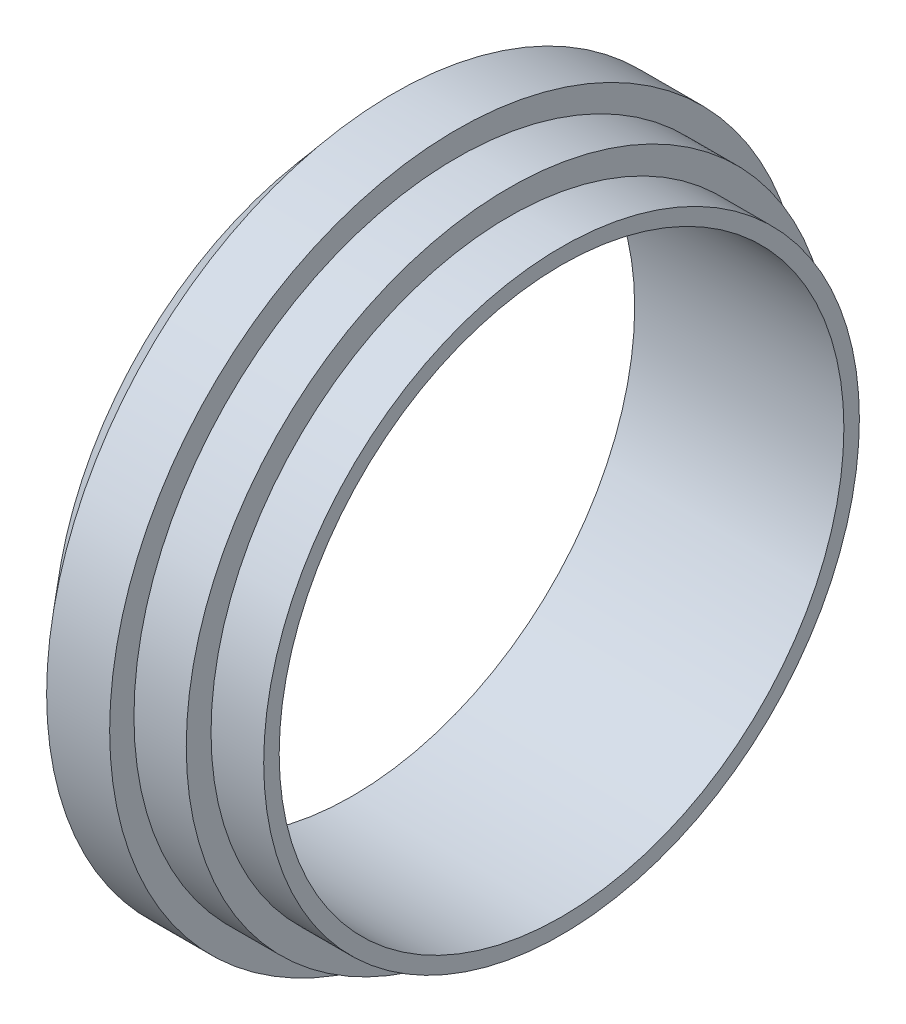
ISO-10303-21;
HEADER;
FILE_DESCRIPTION(('STEP AP214'),'2;1');
FILE_NAME('part.step','',(''),(''),'','','');
FILE_SCHEMA(('AUTOMOTIVE_DESIGN { 1 0 10303 214 1 1 1 1 }'));
ENDSEC;
DATA;
#1=APPLICATION_CONTEXT('core data for automotive mechanical design processes');
#2=APPLICATION_PROTOCOL_DEFINITION('international standard','automotive_design',2000,#1);
#3=PRODUCT_CONTEXT('',#1,'mechanical');
#4=PRODUCT('Part','Part','',(#3));
#5=PRODUCT_RELATED_PRODUCT_CATEGORY('part','',(#4));
#6=PRODUCT_DEFINITION_FORMATION('','',#4);
#7=PRODUCT_DEFINITION_CONTEXT('part definition',#1,'design');
#8=PRODUCT_DEFINITION('design','',#6,#7);
#9=PRODUCT_DEFINITION_SHAPE('','',#8);
#10=(LENGTH_UNIT() NAMED_UNIT(*) SI_UNIT(.MILLI.,.METRE.));
#11=(NAMED_UNIT(*) PLANE_ANGLE_UNIT() SI_UNIT($,.RADIAN.));
#12=(NAMED_UNIT(*) SI_UNIT($,.STERADIAN.) SOLID_ANGLE_UNIT());
#13=UNCERTAINTY_MEASURE_WITH_UNIT(LENGTH_MEASURE(1.E-05),#10,'distance_accuracy_value','');
#14=(GEOMETRIC_REPRESENTATION_CONTEXT(3) GLOBAL_UNCERTAINTY_ASSIGNED_CONTEXT((#13)) GLOBAL_UNIT_ASSIGNED_CONTEXT((#10,
#11,#12)) REPRESENTATION_CONTEXT('',''));
#15=CARTESIAN_POINT('',(0.,0.,0.));
#16=DIRECTION('',(0.,0.,1.));
#17=DIRECTION('',(1.,0.,0.));
#18=AXIS2_PLACEMENT_3D('',#15,#16,#17);
#19=CARTESIAN_POINT('',(0.,31.75,0.));
#20=DIRECTION('',(1.,0.,0.));
#21=DIRECTION('',(0.,0.,-1.));
#22=AXIS2_PLACEMENT_3D('',#19,#20,#21);
#23=PLANE('',#22);
#24=CARTESIAN_POINT('',(0.,31.75,0.));
#25=DIRECTION('',(-1.,0.,0.));
#26=DIRECTION('',(0.,0.,1.));
#27=AXIS2_PLACEMENT_3D('',#24,#25,#26);
#28=CIRCLE('',#27,30.099);
#29=CARTESIAN_POINT('',(0.,31.75,30.099));
#30=VERTEX_POINT('',#29);
#31=EDGE_CURVE('E59',#30,#30,#28,.T.);
#32=ORIENTED_EDGE('',*,*,#31,.T.);
#33=EDGE_LOOP('',(#32));
#34=FACE_BOUND('',#33,.T.);
#35=CARTESIAN_POINT('',(0.,31.75,0.));
#36=DIRECTION('',(-1.,0.,0.));
#37=DIRECTION('',(0.,0.,1.));
#38=AXIS2_PLACEMENT_3D('',#35,#36,#37);
#39=CIRCLE('',#38,31.75);
#40=CARTESIAN_POINT('',(0.,31.75,31.75));
#41=VERTEX_POINT('',#40);
#42=EDGE_CURVE('E10',#41,#41,#39,.T.);
#43=ORIENTED_EDGE('',*,*,#42,.F.);
#44=EDGE_LOOP('',(#43));
#45=FACE_BOUND('',#44,.T.);
#46=ADVANCED_FACE('F31',(#34,#45),#23,.T.);
#47=CARTESIAN_POINT('',(-22.3012,31.75,0.));
#48=DIRECTION('',(-1.,0.,0.));
#49=DIRECTION('',(0.,0.,1.));
#50=AXIS2_PLACEMENT_3D('',#47,#48,#49);
#51=CYLINDRICAL_SURFACE('',#50,31.75);
#52=ORIENTED_EDGE('',*,*,#42,.T.);
#53=EDGE_LOOP('',(#52));
#54=FACE_BOUND('',#53,.T.);
#55=CARTESIAN_POINT('',(-5.6134,31.75,0.));
#56=DIRECTION('',(-1.,0.,0.));
#57=DIRECTION('',(0.,0.,1.));
#58=AXIS2_PLACEMENT_3D('',#55,#56,#57);
#59=CIRCLE('',#58,31.75);
#60=CARTESIAN_POINT('',(-5.6134,31.75,31.75));
#61=VERTEX_POINT('',#60);
#62=EDGE_CURVE('E37',#61,#61,#59,.T.);
#63=ORIENTED_EDGE('',*,*,#62,.F.);
#64=EDGE_LOOP('',(#63));
#65=FACE_BOUND('',#64,.T.);
#66=ADVANCED_FACE('F92',(#54,#65),#51,.T.);
#67=CARTESIAN_POINT('',(-5.6134,0.,0.));
#68=DIRECTION('',(1.,0.,0.));
#69=DIRECTION('',(0.,0.,-1.));
#70=AXIS2_PLACEMENT_3D('',#67,#68,#69);
#71=PLANE('',#70);
#72=ORIENTED_EDGE('',*,*,#62,.T.);
#73=EDGE_LOOP('',(#72));
#74=FACE_BOUND('',#73,.T.);
#75=CARTESIAN_POINT('',(-5.6134,31.75,0.));
#76=DIRECTION('',(-1.,0.,0.));
#77=DIRECTION('',(0.,0.,1.));
#78=AXIS2_PLACEMENT_3D('',#75,#76,#77);
#79=CIRCLE('',#78,34.3916);
#80=CARTESIAN_POINT('',(-5.6134,31.75,34.3916));
#81=VERTEX_POINT('',#80);
#82=EDGE_CURVE('E41',#81,#81,#79,.T.);
#83=ORIENTED_EDGE('',*,*,#82,.F.);
#84=EDGE_LOOP('',(#83));
#85=FACE_BOUND('',#84,.T.);
#86=ADVANCED_FACE('F96',(#74,#85),#71,.T.);
#87=CARTESIAN_POINT('',(-22.3012,31.75,0.));
#88=DIRECTION('',(-1.,0.,0.));
#89=DIRECTION('',(0.,0.,1.));
#90=AXIS2_PLACEMENT_3D('',#87,#88,#89);
#91=CYLINDRICAL_SURFACE('',#90,34.3916);
#92=ORIENTED_EDGE('',*,*,#82,.T.);
#93=EDGE_LOOP('',(#92));
#94=FACE_BOUND('',#93,.T.);
#95=CARTESIAN_POINT('',(-11.1887,31.75,0.));
#96=DIRECTION('',(-1.,0.,0.));
#97=DIRECTION('',(0.,0.,1.));
#98=AXIS2_PLACEMENT_3D('',#95,#96,#97);
#99=CIRCLE('',#98,34.3916);
#100=CARTESIAN_POINT('',(-11.1887,31.75,34.3916));
#101=VERTEX_POINT('',#100);
#102=EDGE_CURVE('E45',#101,#101,#99,.T.);
#103=ORIENTED_EDGE('',*,*,#102,.F.);
#104=EDGE_LOOP('',(#103));
#105=FACE_BOUND('',#104,.T.);
#106=ADVANCED_FACE('F100',(#94,#105),#91,.T.);
#107=CARTESIAN_POINT('',(-11.1887,-2.6416,0.));
#108=DIRECTION('',(1.,0.,0.));
#109=DIRECTION('',(0.,0.,-1.));
#110=AXIS2_PLACEMENT_3D('',#107,#108,#109);
#111=PLANE('',#110);
#112=ORIENTED_EDGE('',*,*,#102,.T.);
#113=EDGE_LOOP('',(#112));
#114=FACE_BOUND('',#113,.T.);
#115=CARTESIAN_POINT('',(-11.1887,31.75,0.));
#116=DIRECTION('',(-1.,0.,0.));
#117=DIRECTION('',(0.,0.,1.));
#118=AXIS2_PLACEMENT_3D('',#115,#116,#117);
#119=CIRCLE('',#118,36.9824);
#120=CARTESIAN_POINT('',(-11.1887,31.75,36.9824));
#121=VERTEX_POINT('',#120);
#122=EDGE_CURVE('E50',#121,#121,#119,.T.);
#123=ORIENTED_EDGE('',*,*,#122,.F.);
#124=EDGE_LOOP('',(#123));
#125=FACE_BOUND('',#124,.T.);
#126=ADVANCED_FACE('F88',(#114,#125),#111,.T.);
#127=CARTESIAN_POINT('',(-22.3012,31.75,0.));
#128=DIRECTION('',(-1.,0.,0.));
#129=DIRECTION('',(0.,0.,1.));
#130=AXIS2_PLACEMENT_3D('',#127,#128,#129);
#131=CYLINDRICAL_SURFACE('',#130,36.9824);
#132=ORIENTED_EDGE('',*,*,#122,.T.);
#133=EDGE_LOOP('',(#132));
#134=FACE_BOUND('',#133,.T.);
#135=CARTESIAN_POINT('',(-17.907,31.75,0.));
#136=DIRECTION('',(-1.,0.,0.));
#137=DIRECTION('',(0.,0.,1.));
#138=AXIS2_PLACEMENT_3D('',#135,#136,#137);
#139=CIRCLE('',#138,36.9824);
#140=CARTESIAN_POINT('',(-17.907,31.75,36.9824));
#141=VERTEX_POINT('',#140);
#142=EDGE_CURVE('E53',#141,#141,#139,.T.);
#143=ORIENTED_EDGE('',*,*,#142,.F.);
#144=EDGE_LOOP('',(#143));
#145=FACE_BOUND('',#144,.T.);
#146=ADVANCED_FACE('F82',(#134,#145),#131,.T.);
#147=CARTESIAN_POINT('',(-22.3012,31.75,0.));
#148=DIRECTION('',(1.,0.,0.));
#149=DIRECTION('',(0.,0.,-1.));
#150=AXIS2_PLACEMENT_3D('',#147,#148,#149);
#151=CONICAL_SURFACE('',#150,31.8262,0.865016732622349);
#152=ORIENTED_EDGE('',*,*,#142,.T.);
#153=EDGE_LOOP('',(#152));
#154=FACE_BOUND('',#153,.T.);
#155=CARTESIAN_POINT('',(-22.3012,31.75,0.));
#156=DIRECTION('',(-1.,0.,0.));
#157=DIRECTION('',(0.,0.,1.));
#158=AXIS2_PLACEMENT_3D('',#155,#156,#157);
#159=CIRCLE('',#158,31.8262);
#160=CARTESIAN_POINT('',(-22.3012,31.75,31.8262));
#161=VERTEX_POINT('',#160);
#162=EDGE_CURVE('E56',#161,#161,#159,.T.);
#163=ORIENTED_EDGE('',*,*,#162,.F.);
#164=EDGE_LOOP('',(#163));
#165=FACE_BOUND('',#164,.T.);
#166=ADVANCED_FACE('F77',(#154,#165),#151,.T.);
#167=CARTESIAN_POINT('',(-22.3012,-0.0761999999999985,0.));
#168=DIRECTION('',(-1.,0.,0.));
#169=DIRECTION('',(0.,0.,1.));
#170=AXIS2_PLACEMENT_3D('',#167,#168,#169);
#171=PLANE('',#170);
#172=CARTESIAN_POINT('',(-22.3012,31.75,0.));
#173=DIRECTION('',(-1.,0.,0.));
#174=DIRECTION('',(0.,0.,1.));
#175=AXIS2_PLACEMENT_3D('',#172,#173,#174);
#176=CIRCLE('',#175,30.099);
#177=CARTESIAN_POINT('',(-22.3012,31.75,30.099));
#178=VERTEX_POINT('',#177);
#179=EDGE_CURVE('E60',#178,#178,#176,.T.);
#180=ORIENTED_EDGE('',*,*,#179,.F.);
#181=EDGE_LOOP('',(#180));
#182=FACE_BOUND('',#181,.T.);
#183=ORIENTED_EDGE('',*,*,#162,.T.);
#184=EDGE_LOOP('',(#183));
#185=FACE_BOUND('',#184,.T.);
#186=ADVANCED_FACE('F71',(#182,#185),#171,.T.);
#187=CARTESIAN_POINT('',(0.,31.75,0.));
#188=DIRECTION('',(-1.,0.,0.));
#189=DIRECTION('',(0.,0.,1.));
#190=AXIS2_PLACEMENT_3D('',#187,#188,#189);
#191=CYLINDRICAL_SURFACE('',#190,30.099);
#192=ORIENTED_EDGE('',*,*,#31,.F.);
#193=EDGE_LOOP('',(#192));
#194=FACE_BOUND('',#193,.T.);
#195=ORIENTED_EDGE('',*,*,#179,.T.);
#196=EDGE_LOOP('',(#195));
#197=FACE_BOUND('',#196,.T.);
#198=ADVANCED_FACE('F68',(#194,#197),#191,.F.);
#199=CLOSED_SHELL('',(#46,#66,#86,#106,#126,#146,#166,#186,#198));
#200=MANIFOLD_SOLID_BREP('B2',#199);
#201=ADVANCED_BREP_SHAPE_REPRESENTATION('',(#18,#200),#14);
#202=SHAPE_DEFINITION_REPRESENTATION(#9,#201);
ENDSEC;
END-ISO-10303-21;
